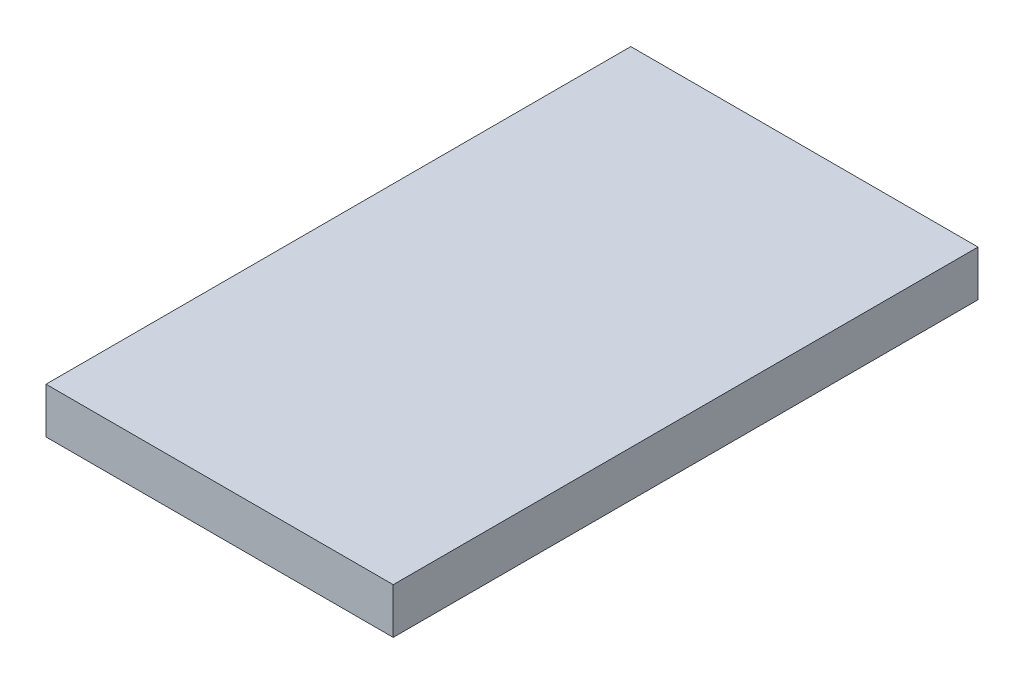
from build123d import *

# Parameters (mm, degrees)
ESQUISSE1_W        = 38
ESQUISSE1_H        = 64
BOSS_EXTRU_1_DEPTH = 5


with BuildPart() as part:
    # Esquisse1 → Boss.-Extru.1 (new body)
    with BuildSketch(Plane(origin=(0, 0, 0), x_dir=(1, 0, 0), z_dir=(0, 1, 0))):
        Rectangle(ESQUISSE1_W, ESQUISSE1_H)
    extrude(amount=BOSS_EXTRU_1_DEPTH)


solid = part.part
